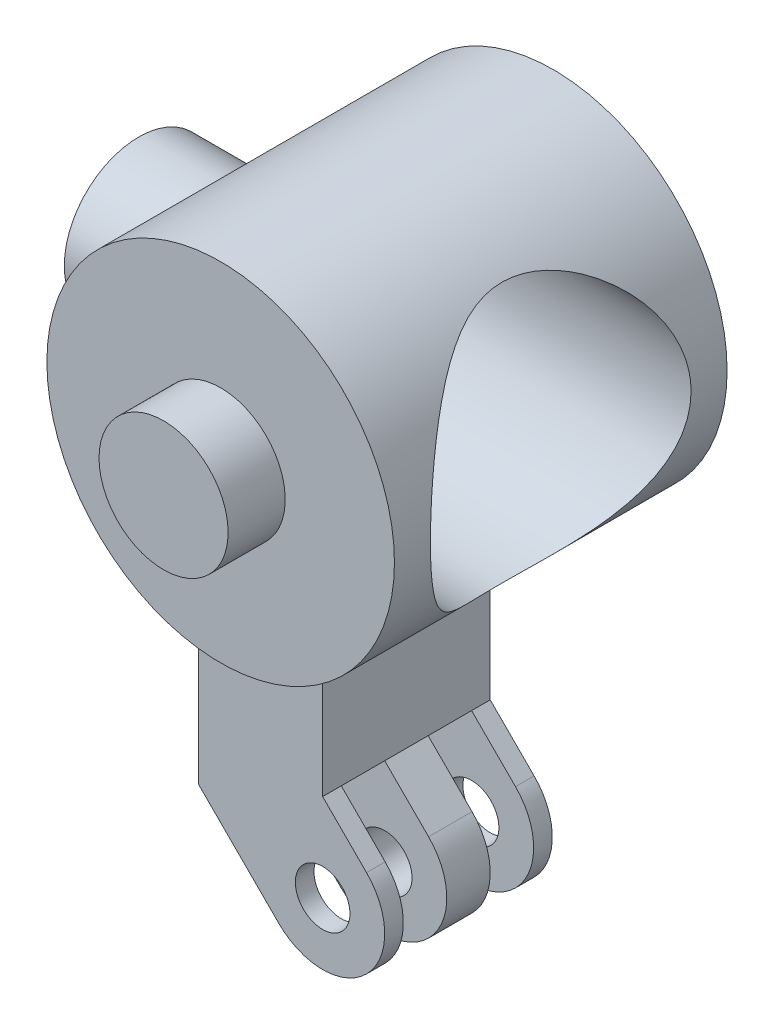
ISO-10303-21;
HEADER;
FILE_DESCRIPTION(('STEP AP214'),'2;1');
FILE_NAME('part.step','',(''),(''),'','','');
FILE_SCHEMA(('AUTOMOTIVE_DESIGN { 1 0 10303 214 1 1 1 1 }'));
ENDSEC;
DATA;
#1=APPLICATION_CONTEXT('core data for automotive mechanical design processes');
#2=APPLICATION_PROTOCOL_DEFINITION('international standard','automotive_design',2000,#1);
#3=PRODUCT_CONTEXT('',#1,'mechanical');
#4=PRODUCT('Part','Part','',(#3));
#5=PRODUCT_RELATED_PRODUCT_CATEGORY('part','',(#4));
#6=PRODUCT_DEFINITION_FORMATION('','',#4);
#7=PRODUCT_DEFINITION_CONTEXT('part definition',#1,'design');
#8=PRODUCT_DEFINITION('design','',#6,#7);
#9=PRODUCT_DEFINITION_SHAPE('','',#8);
#10=(LENGTH_UNIT() NAMED_UNIT(*) SI_UNIT(.MILLI.,.METRE.));
#11=(NAMED_UNIT(*) PLANE_ANGLE_UNIT() SI_UNIT($,.RADIAN.));
#12=(NAMED_UNIT(*) SI_UNIT($,.STERADIAN.) SOLID_ANGLE_UNIT());
#13=UNCERTAINTY_MEASURE_WITH_UNIT(LENGTH_MEASURE(1.E-05),#10,'distance_accuracy_value','');
#14=(GEOMETRIC_REPRESENTATION_CONTEXT(3) GLOBAL_UNCERTAINTY_ASSIGNED_CONTEXT((#13)) GLOBAL_UNIT_ASSIGNED_CONTEXT((#10,
#11,#12)) REPRESENTATION_CONTEXT('',''));
#15=CARTESIAN_POINT('',(0.,0.,0.));
#16=DIRECTION('',(0.,0.,1.));
#17=DIRECTION('',(1.,0.,0.));
#18=AXIS2_PLACEMENT_3D('',#15,#16,#17);
#19=CARTESIAN_POINT('',(-28.5875999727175,51.1546126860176,23.4989898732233));
#20=DIRECTION('',(0.,0.,-1.));
#21=DIRECTION('',(1.,0.,0.));
#22=AXIS2_PLACEMENT_3D('',#19,#20,#21);
#23=CYLINDRICAL_SURFACE('',#22,7.);
#24=CARTESIAN_POINT('',(-35.5875999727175,51.1546126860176,-2.));
#25=CARTESIAN_POINT('',(-35.5875940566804,51.3148944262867,-2.00000746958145));
#26=CARTESIAN_POINT('',(-35.5820324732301,51.47544659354,-2.01292131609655));
#27=CARTESIAN_POINT('',(-35.5603391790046,51.7919620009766,-2.06408236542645));
#28=CARTESIAN_POINT('',(-35.5441807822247,51.9479126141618,-2.10239352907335));
#29=CARTESIAN_POINT('',(-35.5030162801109,52.2501473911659,-2.20266976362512));
#30=CARTESIAN_POINT('',(-35.4780408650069,52.3964630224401,-2.2645528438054));
#31=CARTESIAN_POINT('',(-35.4216565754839,52.6764860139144,-2.40986441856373));
#32=CARTESIAN_POINT('',(-35.3902494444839,52.8101967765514,-2.4932870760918));
#33=CARTESIAN_POINT('',(-35.3222781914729,53.068454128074,-2.68392764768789));
#34=CARTESIAN_POINT('',(-35.2855389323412,53.1922531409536,-2.79209525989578));
#35=CARTESIAN_POINT('',(-35.2117765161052,53.4206030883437,-3.02714386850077));
#36=CARTESIAN_POINT('',(-35.1747532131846,53.5251433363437,-3.15403518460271));
#37=CARTESIAN_POINT('',(-35.1024205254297,53.7174695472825,-3.4310327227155));
#38=CARTESIAN_POINT('',(-35.0673045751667,53.804080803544,-3.5820104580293));
#39=CARTESIAN_POINT('',(-35.0055616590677,53.9503446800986,-3.89810942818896));
#40=CARTESIAN_POINT('',(-34.9789300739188,54.0100119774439,-4.06322290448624));
#41=CARTESIAN_POINT('',(-34.9390779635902,54.0975618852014,-4.39430073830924));
#42=CARTESIAN_POINT('',(-34.9252521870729,54.1268876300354,-4.55980770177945));
#43=CARTESIAN_POINT('',(-34.9108484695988,54.1574187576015,-4.89392596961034));
#44=CARTESIAN_POINT('',(-34.9102625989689,54.1586409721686,-5.06253535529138));
#45=CARTESIAN_POINT('',(-34.9218957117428,54.1340126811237,-5.38329990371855));
#46=CARTESIAN_POINT('',(-34.933068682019,54.1103738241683,-5.53567062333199));
#47=CARTESIAN_POINT('',(-34.9651840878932,54.0404204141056,-5.83402758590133));
#48=CARTESIAN_POINT('',(-34.9861285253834,53.994101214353,-5.98001251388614));
#49=CARTESIAN_POINT('',(-35.0359068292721,53.8791892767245,-6.26524715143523));
#50=CARTESIAN_POINT('',(-35.0649029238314,53.8101324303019,-6.40428029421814));
#51=CARTESIAN_POINT('',(-35.1274849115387,53.6520357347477,-6.66934632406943));
#52=CARTESIAN_POINT('',(-35.1610726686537,53.5629877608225,-6.79537389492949));
#53=CARTESIAN_POINT('',(-35.2327240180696,53.3580467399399,-7.04277750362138));
#54=CARTESIAN_POINT('',(-35.2709185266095,53.2404599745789,-7.16271672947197));
#55=CARTESIAN_POINT('',(-35.3449460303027,52.9864860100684,-7.38167159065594));
#56=CARTESIAN_POINT('',(-35.380778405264,52.8500939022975,-7.48068174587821));
#57=CARTESIAN_POINT('',(-35.4471969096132,52.5577985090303,-7.65724393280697));
#58=CARTESIAN_POINT('',(-35.4776245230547,52.4014838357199,-7.73417901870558));
#59=CARTESIAN_POINT('',(-35.528573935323,52.0764923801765,-7.86015023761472));
#60=CARTESIAN_POINT('',(-35.5491015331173,51.9078229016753,-7.9092027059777));
#61=CARTESIAN_POINT('',(-35.5768352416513,51.574888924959,-7.97493386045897));
#62=CARTESIAN_POINT('',(-35.5848324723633,51.4110706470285,-7.99353876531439));
#63=CARTESIAN_POINT('',(-35.5891541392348,51.0824693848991,-8.00362957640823));
#64=CARTESIAN_POINT('',(-35.5854821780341,50.9176867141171,-7.99512385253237));
#65=CARTESIAN_POINT('',(-35.567386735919,50.6010702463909,-7.95258436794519));
#66=CARTESIAN_POINT('',(-35.5535451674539,50.4490137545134,-7.91993167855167));
#67=CARTESIAN_POINT('',(-35.5171388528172,50.1527215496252,-7.83197910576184));
#68=CARTESIAN_POINT('',(-35.4945730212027,50.0084868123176,-7.77667640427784));
#69=CARTESIAN_POINT('',(-35.4419874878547,49.7268357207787,-7.64319884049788));
#70=CARTESIAN_POINT('',(-35.4117570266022,49.5897729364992,-7.56436366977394));
#71=CARTESIAN_POINT('',(-35.3470298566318,49.3303277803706,-7.38678105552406));
#72=CARTESIAN_POINT('',(-35.312531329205,49.2079517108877,-7.28802511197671));
#73=CARTESIAN_POINT('',(-35.2397478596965,48.9716450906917,-7.06471041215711));
#74=CARTESIAN_POINT('',(-35.2013735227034,48.8590465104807,-6.93876778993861));
#75=CARTESIAN_POINT('',(-35.12744034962,48.6561783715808,-6.66921770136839));
#76=CARTESIAN_POINT('',(-35.0918822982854,48.5659150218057,-6.52560533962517));
#77=CARTESIAN_POINT('',(-35.0272296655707,48.4089739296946,-6.22118614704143));
#78=CARTESIAN_POINT('',(-34.9982625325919,48.3427485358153,-6.06011699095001));
#79=CARTESIAN_POINT('',(-34.9517360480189,48.2389538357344,-5.72747367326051));
#80=CARTESIAN_POINT('',(-34.9341665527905,48.2013590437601,-5.55590900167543));
#81=CARTESIAN_POINT('',(-34.9140347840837,48.1584932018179,-5.22200882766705));
#82=CARTESIAN_POINT('',(-34.9103792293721,48.1508657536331,-5.06004073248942));
#83=CARTESIAN_POINT('',(-34.9155561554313,48.1617861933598,-4.73721025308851));
#84=CARTESIAN_POINT('',(-34.9243864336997,48.1803294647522,-4.57634767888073));
#85=CARTESIAN_POINT('',(-34.9525165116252,48.2410483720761,-4.26895830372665));
#86=CARTESIAN_POINT('',(-34.9712471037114,48.2819429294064,-4.12212120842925));
#87=CARTESIAN_POINT('',(-35.0165887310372,48.3849104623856,-3.83737923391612));
#88=CARTESIAN_POINT('',(-35.0432020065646,48.446989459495,-3.69947690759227));
#89=CARTESIAN_POINT('',(-35.1033524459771,48.5949801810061,-3.42717929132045));
#90=CARTESIAN_POINT('',(-35.1372164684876,48.6821303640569,-3.29353084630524));
#91=CARTESIAN_POINT('',(-35.2071977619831,48.8761166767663,-3.04201763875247));
#92=CARTESIAN_POINT('',(-35.2433158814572,48.9829602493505,-2.92415887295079));
#93=CARTESIAN_POINT('',(-35.3171542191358,49.2232621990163,-2.69799636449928));
#94=CARTESIAN_POINT('',(-35.3547759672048,49.3581554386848,-2.59118043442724));
#95=CARTESIAN_POINT('',(-35.4245647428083,49.6454150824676,-2.40156023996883));
#96=CARTESIAN_POINT('',(-35.4567292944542,49.7977893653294,-2.31876686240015));
#97=CARTESIAN_POINT('',(-35.4979543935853,50.0350673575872,-2.21540730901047));
#98=CARTESIAN_POINT('',(-35.510463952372,50.1150398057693,-2.18456670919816));
#99=CARTESIAN_POINT('',(-35.5329319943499,50.2776418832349,-2.12976179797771));
#100=CARTESIAN_POINT('',(-35.5428916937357,50.3602702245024,-2.10579420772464));
#101=CARTESIAN_POINT('',(-35.559943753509,50.5273471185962,-2.06505228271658));
#102=CARTESIAN_POINT('',(-35.5670431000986,50.6117906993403,-2.04826041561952));
#103=CARTESIAN_POINT('',(-35.5781931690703,50.7819647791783,-2.02199128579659));
#104=CARTESIAN_POINT('',(-35.5822460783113,50.8676943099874,-2.0125087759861));
#105=CARTESIAN_POINT('',(-35.5856758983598,50.9871200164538,-2.00449172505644));
#106=CARTESIAN_POINT('',(-35.5863967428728,51.0205915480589,-2.00280814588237));
#107=CARTESIAN_POINT('',(-35.5873594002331,51.0875756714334,-2.00056149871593));
#108=CARTESIAN_POINT('',(-35.5876012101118,51.1210882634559,-1.99999843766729));
#109=CARTESIAN_POINT('',(-35.5875999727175,51.1546126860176,-2.));
#110=B_SPLINE_CURVE_WITH_KNOTS('',3,(#24,#25,#26,#27,#28,#29,#30,#31,#32,#33,#34,#35,#36,#37,
#38,#39,#40,#41,#42,#43,#44,#45,#46,#47,#48,#49,#50,#51,#52,#53,#54,#55,#56,#57,#58,#59,#60,#61,
#62,#63,#64,#65,#66,#67,#68,#69,#70,#71,#72,#73,#74,#75,#76,#77,#78,#79,#80,#81,#82,#83,#84,#85,
#86,#87,#88,#89,#90,#91,#92,#93,#94,#95,#96,#97,#98,#99,#100,#101,#102,#103,#104,#105,#106,#107,
#108,#109),.UNSPECIFIED.,.T.,.F.,(4,2,2,2,2,2,2,2,2,2,2,2,2,2,2,2,2,2,2,2,2,2,2,2,2,2,2,2,2,2,2,
2,2,2,2,2,2,2,2,2,2,2,4),(0.,0.480714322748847,0.962643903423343,1.44291226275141,
1.92305060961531,2.42622743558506,2.92968263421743,3.45969560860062,3.98941952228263,
4.492594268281,4.99546764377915,5.45710720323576,5.91884138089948,6.3906540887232,
6.86265889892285,7.3770983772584,7.89167239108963,8.41947244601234,8.94696296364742,
9.43957347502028,9.93203191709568,10.3983119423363,10.8646499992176,11.3455505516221,
11.8266567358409,12.3440285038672,12.8615439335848,13.3883469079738,13.9146803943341,
14.3986848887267,14.882604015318,15.341320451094,15.8001673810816,16.2874475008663,
16.7749121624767,17.3008416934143,17.8270092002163,18.0865840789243,18.3460349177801,
18.6048481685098,18.8634754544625,18.964020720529,19.0645666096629),.UNSPECIFIED.);
#111=CARTESIAN_POINT('',(-35.5875999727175,51.1546126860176,-2.));
#112=VERTEX_POINT('',#111);
#113=EDGE_CURVE('E275',#112,#112,#110,.T.);
#114=ORIENTED_EDGE('',*,*,#113,.F.);
#115=EDGE_LOOP('',(#114));
#116=FACE_BOUND('',#115,.T.);
#117=CARTESIAN_POINT('',(-28.5875999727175,51.1546126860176,1.7));
#118=DIRECTION('',(0.,0.,-1.));
#119=DIRECTION('',(-1.,0.,0.));
#120=AXIS2_PLACEMENT_3D('',#117,#118,#119);
#121=CIRCLE('',#120,7.);
#122=CARTESIAN_POINT('',(-35.5875999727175,51.1546126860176,1.7));
#123=VERTEX_POINT('',#122);
#124=EDGE_CURVE('E270',#123,#123,#121,.F.);
#125=ORIENTED_EDGE('',*,*,#124,.F.);
#126=EDGE_LOOP('',(#125));
#127=FACE_BOUND('',#126,.T.);
#128=CARTESIAN_POINT('',(-28.5875999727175,51.1546126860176,-11.7));
#129=DIRECTION('',(0.,0.,1.));
#130=DIRECTION('',(1.,0.,0.));
#131=AXIS2_PLACEMENT_3D('',#128,#129,#130);
#132=CIRCLE('',#131,7.);
#133=CARTESIAN_POINT('',(-21.5875999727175,51.1546126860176,-11.7));
#134=VERTEX_POINT('',#133);
#135=EDGE_CURVE('E267',#134,#134,#132,.T.);
#136=ORIENTED_EDGE('',*,*,#135,.T.);
#137=EDGE_LOOP('',(#136));
#138=FACE_BOUND('',#137,.T.);
#139=CARTESIAN_POINT('',(-21.5875999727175,51.1546126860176,0.25));
#140=CARTESIAN_POINT('',(-21.5876011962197,51.2828165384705,0.249998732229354));
#141=CARTESIAN_POINT('',(-21.591130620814,51.4110524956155,0.245295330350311));
#142=CARTESIAN_POINT('',(-21.605168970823,51.6665119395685,0.2265552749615));
#143=CARTESIAN_POINT('',(-21.6156820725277,51.7937347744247,0.212513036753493));
#144=CARTESIAN_POINT('',(-21.6434657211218,52.0463376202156,0.175292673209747));
#145=CARTESIAN_POINT('',(-21.6607491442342,52.1717136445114,0.152097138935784));
#146=CARTESIAN_POINT('',(-21.7016847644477,52.4195052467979,0.096927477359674));
#147=CARTESIAN_POINT('',(-21.7253398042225,52.5419194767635,0.0649494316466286));
#148=CARTESIAN_POINT('',(-21.7783333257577,52.7821616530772,-0.00708457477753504));
#149=CARTESIAN_POINT('',(-21.8076333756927,52.900014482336,-0.0470859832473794));
#150=CARTESIAN_POINT('',(-21.8714395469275,53.1313816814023,-0.134795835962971));
#151=CARTESIAN_POINT('',(-21.905947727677,53.244894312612,-0.182507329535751));
#152=CARTESIAN_POINT('',(-22.0163020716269,53.5779594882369,-0.336353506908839));
#153=CARTESIAN_POINT('',(-22.0990495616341,53.7903522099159,-0.453295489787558));
#154=CARTESIAN_POINT('',(-22.2858703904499,54.2117789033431,-0.723930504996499));
#155=CARTESIAN_POINT('',(-22.3912089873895,54.4186804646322,-0.880023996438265));
#156=CARTESIAN_POINT('',(-22.6107695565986,54.8052163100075,-1.21824710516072));
#157=CARTESIAN_POINT('',(-22.7250051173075,54.9848075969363,-1.4004169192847));
#158=CARTESIAN_POINT('',(-22.908986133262,55.2494953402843,-1.71093747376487));
#159=CARTESIAN_POINT('',(-22.9783440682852,55.3437535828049,-1.83185332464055));
#160=CARTESIAN_POINT('',(-23.1157543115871,55.5217085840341,-2.08203035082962));
#161=CARTESIAN_POINT('',(-23.1838062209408,55.6054021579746,-2.21129402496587));
#162=CARTESIAN_POINT('',(-23.3164288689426,55.7616996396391,-2.47787979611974));
#163=CARTESIAN_POINT('',(-23.3810030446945,55.8343146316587,-2.61519364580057));
#164=CARTESIAN_POINT('',(-23.5042350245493,55.9678915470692,-2.89779004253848));
#165=CARTESIAN_POINT('',(-23.5628961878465,56.0288601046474,-3.04306799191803));
#166=CARTESIAN_POINT('',(-23.688398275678,56.1554188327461,-3.3882174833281));
#167=CARTESIAN_POINT('',(-23.7520888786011,56.2165253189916,-3.59099031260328));
#168=CARTESIAN_POINT('',(-23.8305210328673,56.289929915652,-3.90342880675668));
#169=CARTESIAN_POINT('',(-23.8538061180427,56.3113486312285,-4.00889288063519));
#170=CARTESIAN_POINT('',(-23.8938122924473,56.3477900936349,-4.22212616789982));
#171=CARTESIAN_POINT('',(-23.9105367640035,56.3628161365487,-4.32989416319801));
#172=CARTESIAN_POINT('',(-23.9368035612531,56.3862863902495,-4.54806927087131));
#173=CARTESIAN_POINT('',(-23.9462764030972,56.3946669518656,-4.65849170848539));
#174=CARTESIAN_POINT('',(-23.9573028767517,56.4044130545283,-4.88004350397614));
#175=CARTESIAN_POINT('',(-23.9588567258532,56.4057787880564,-4.99117284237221));
#176=CARTESIAN_POINT('',(-23.953959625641,56.4014583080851,-5.21315493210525));
#177=CARTESIAN_POINT('',(-23.9475060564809,56.3957697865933,-5.32400758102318));
#178=CARTESIAN_POINT('',(-23.9269346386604,56.3774833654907,-5.54439475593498));
#179=CARTESIAN_POINT('',(-23.9128167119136,56.3648853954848,-5.65392926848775));
#180=CARTESIAN_POINT('',(-23.8637130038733,56.3205331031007,-5.95602478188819));
#181=CARTESIAN_POINT('',(-23.8210449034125,56.2815038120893,-6.14632390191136));
#182=CARTESIAN_POINT('',(-23.7186077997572,56.1843070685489,-6.5170895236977));
#183=CARTESIAN_POINT('',(-23.6588223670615,56.1261212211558,-6.69754637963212));
#184=CARTESIAN_POINT('',(-23.5399058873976,56.005034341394,-7.01471865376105));
#185=CARTESIAN_POINT('',(-23.4827354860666,55.9450404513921,-7.15331164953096));
#186=CARTESIAN_POINT('',(-23.363204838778,55.8143910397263,-7.42310663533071));
#187=CARTESIAN_POINT('',(-23.3008419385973,55.7437300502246,-7.55430478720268));
#188=CARTESIAN_POINT('',(-23.172975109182,55.5921449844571,-7.80942488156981));
#189=CARTESIAN_POINT('',(-23.1074649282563,55.5111999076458,-7.93333115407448));
#190=CARTESIAN_POINT('',(-22.9752694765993,55.3395246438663,-8.17345128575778));
#191=CARTESIAN_POINT('',(-22.9085843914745,55.2487959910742,-8.28966634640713));
#192=CARTESIAN_POINT('',(-22.773958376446,55.0553552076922,-8.5170343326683));
#193=CARTESIAN_POINT('',(-22.7060279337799,54.9523994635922,-8.62798699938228));
#194=CARTESIAN_POINT('',(-22.5721726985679,54.7366231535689,-8.84118916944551));
#195=CARTESIAN_POINT('',(-22.5062487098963,54.6237987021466,-8.94343521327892));
#196=CARTESIAN_POINT('',(-22.3140072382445,54.2712403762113,-9.23581417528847));
#197=CARTESIAN_POINT('',(-22.1928024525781,54.016844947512,-9.41226990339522));
#198=CARTESIAN_POINT('',(-21.9977858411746,53.5271983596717,-9.68996462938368));
#199=CARTESIAN_POINT('',(-21.9193442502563,53.2983396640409,-9.79919123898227));
#200=CARTESIAN_POINT('',(-21.8182195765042,52.9409166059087,-9.93842210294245));
#201=CARTESIAN_POINT('',(-21.7872617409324,52.8193863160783,-9.98073868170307));
#202=CARTESIAN_POINT('',(-21.7314900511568,52.5722770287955,-10.0566203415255));
#203=CARTESIAN_POINT('',(-21.7066735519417,52.446699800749,-10.0901891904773));
#204=CARTESIAN_POINT('',(-21.6636006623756,52.1914794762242,-10.1482664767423));
#205=CARTESIAN_POINT('',(-21.6453877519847,52.0618153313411,-10.1727148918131));
#206=CARTESIAN_POINT('',(-21.6161921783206,51.8002068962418,-10.2118323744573));
#207=CARTESIAN_POINT('',(-21.6052095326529,51.6682626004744,-10.2265014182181));
#208=CARTESIAN_POINT('',(-21.5907600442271,51.4032739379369,-10.2457897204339));
#209=CARTESIAN_POINT('',(-21.587290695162,51.270229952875,-10.250412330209));
#210=CARTESIAN_POINT('',(-21.5879524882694,51.0042008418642,-10.2495300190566));
#211=CARTESIAN_POINT('',(-21.5920830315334,50.8712157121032,-10.2440258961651));
#212=CARTESIAN_POINT('',(-21.6070368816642,50.6198628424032,-10.2240595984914));
#213=CARTESIAN_POINT('',(-21.6171428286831,50.5013741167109,-10.2105573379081));
#214=CARTESIAN_POINT('',(-21.6431998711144,50.2661807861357,-10.175647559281));
#215=CARTESIAN_POINT('',(-21.6591529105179,50.1494767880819,-10.1542374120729));
#216=CARTESIAN_POINT('',(-21.6965853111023,49.9186600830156,-10.1038092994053));
#217=CARTESIAN_POINT('',(-21.7180633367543,49.8045467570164,-10.0747931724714));
#218=CARTESIAN_POINT('',(-21.7661422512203,49.5794993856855,-10.0095177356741));
#219=CARTESIAN_POINT('',(-21.7927451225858,49.4685665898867,-9.97325562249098));
#220=CARTESIAN_POINT('',(-21.8815843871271,49.1337852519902,-9.85142686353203));
#221=CARTESIAN_POINT('',(-21.9515212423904,48.9159470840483,-9.7545807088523));
#222=CARTESIAN_POINT('',(-22.106762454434,48.4997613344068,-9.53538656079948));
#223=CARTESIAN_POINT('',(-22.1920689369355,48.3014164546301,-9.41303503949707));
#224=CARTESIAN_POINT('',(-22.388422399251,47.8943391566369,-9.12376581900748));
#225=CARTESIAN_POINT('',(-22.501388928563,47.6894036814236,-8.9528178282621));
#226=CARTESIAN_POINT('',(-22.7342593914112,47.3090688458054,-8.58395160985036));
#227=CARTESIAN_POINT('',(-22.8541783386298,47.1337368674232,-8.38597366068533));
#228=CARTESIAN_POINT('',(-23.0438808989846,46.8789515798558,-8.0505572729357));
#229=CARTESIAN_POINT('',(-23.1143214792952,46.7894047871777,-7.92102721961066));
#230=CARTESIAN_POINT('',(-23.2524168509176,46.6216658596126,-7.65327475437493));
#231=CARTESIAN_POINT('',(-23.3200706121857,46.5434778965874,-7.51504917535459));
#232=CARTESIAN_POINT('',(-23.4498889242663,46.3992661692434,-7.23037263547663));
#233=CARTESIAN_POINT('',(-23.512066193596,46.3332138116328,-7.08394209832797));
#234=CARTESIAN_POINT('',(-23.6280696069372,46.213968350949,-6.78290575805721));
#235=CARTESIAN_POINT('',(-23.6819026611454,46.1607645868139,-6.62830686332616));
#236=CARTESIAN_POINT('',(-23.7884298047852,46.0580798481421,-6.27608541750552));
#237=CARTESIAN_POINT('',(-23.8382376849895,46.0120258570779,-6.0765107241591));
#238=CARTESIAN_POINT('',(-23.894830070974,45.9605255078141,-5.77112968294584));
#239=CARTESIAN_POINT('',(-23.9106706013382,45.9462917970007,-5.668390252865));
#240=CARTESIAN_POINT('',(-23.9357257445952,45.9238999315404,-5.46146664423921));
#241=CARTESIAN_POINT('',(-23.9449433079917,45.9157390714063,-5.35728313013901));
#242=CARTESIAN_POINT('',(-23.9563699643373,45.9056349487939,-5.14766674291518));
#243=CARTESIAN_POINT('',(-23.9585410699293,45.9037253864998,-5.04223016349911));
#244=CARTESIAN_POINT('',(-23.955668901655,45.9062588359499,-4.83153480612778));
#245=CARTESIAN_POINT('',(-23.9506257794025,45.9107017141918,-4.72627602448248));
#246=CARTESIAN_POINT('',(-23.9335516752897,45.9258496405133,-4.51669099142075));
#247=CARTESIAN_POINT('',(-23.9215142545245,45.9365604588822,-4.41236568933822));
#248=CARTESIAN_POINT('',(-23.8909688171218,45.9640371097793,-4.2054377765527));
#249=CARTESIAN_POINT('',(-23.8724574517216,45.9808060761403,-4.1028360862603));
#250=CARTESIAN_POINT('',(-23.8250310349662,46.0243897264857,-3.87788699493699));
#251=CARTESIAN_POINT('',(-23.7947285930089,46.0525964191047,-3.7561017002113));
#252=CARTESIAN_POINT('',(-23.7270747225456,46.1170069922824,-3.51661640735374));
#253=CARTESIAN_POINT('',(-23.6897179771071,46.1532169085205,-3.39891957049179));
#254=CARTESIAN_POINT('',(-23.6093869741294,46.2331687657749,-3.16782360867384));
#255=CARTESIAN_POINT('',(-23.5664016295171,46.2769256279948,-3.05443355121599));
#256=CARTESIAN_POINT('',(-23.4762720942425,46.3714554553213,-2.83240615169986));
#257=CARTESIAN_POINT('',(-23.4291291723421,46.4222262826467,-2.72376737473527));
#258=CARTESIAN_POINT('',(-23.3150072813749,46.5492506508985,-2.47434008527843));
#259=CARTESIAN_POINT('',(-23.2468243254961,46.6282313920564,-2.33548572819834));
#260=CARTESIAN_POINT('',(-23.1076583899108,46.7977469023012,-2.06648592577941));
#261=CARTESIAN_POINT('',(-23.0366745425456,46.8882852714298,-1.93634321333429));
#262=CARTESIAN_POINT('',(-22.8940192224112,47.0806115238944,-1.68487012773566));
#263=CARTESIAN_POINT('',(-22.8223472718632,47.1824078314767,-1.56354646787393));
#264=CARTESIAN_POINT('',(-22.6802816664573,47.3969348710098,-1.33019474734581));
#265=CARTESIAN_POINT('',(-22.6098878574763,47.509664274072,-1.21816556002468));
#266=CARTESIAN_POINT('',(-22.4715431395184,47.7468485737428,-1.00306539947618));
#267=CARTESIAN_POINT('',(-22.4036177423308,47.8713940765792,-0.900077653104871));
#268=CARTESIAN_POINT('',(-22.2725625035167,48.1311279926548,-0.704954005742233));
#269=CARTESIAN_POINT('',(-22.2094332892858,48.2663177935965,-0.612819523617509));
#270=CARTESIAN_POINT('',(-22.0898061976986,48.546577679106,-0.440652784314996));
#271=CARTESIAN_POINT('',(-22.0332957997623,48.6916282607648,-0.360597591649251));
#272=CARTESIAN_POINT('',(-21.9284686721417,48.9910300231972,-0.21364636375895));
#273=CARTESIAN_POINT('',(-21.8801477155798,49.1453763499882,-0.146743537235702));
#274=CARTESIAN_POINT('',(-21.8060242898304,49.4157258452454,-0.0448915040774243));
#275=CARTESIAN_POINT('',(-21.7777725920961,49.5297096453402,-0.006323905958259));
#276=CARTESIAN_POINT('',(-21.7266721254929,49.7611632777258,0.0631399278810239));
#277=CARTESIAN_POINT('',(-21.7038220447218,49.8786322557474,0.0940380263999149));
#278=CARTESIAN_POINT('',(-21.6640202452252,50.1161008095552,0.147696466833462));
#279=CARTESIAN_POINT('',(-21.6470548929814,50.2360938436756,0.170475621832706));
#280=CARTESIAN_POINT('',(-21.619310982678,50.47803440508,0.207658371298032));
#281=CARTESIAN_POINT('',(-21.608529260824,50.599980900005,0.222066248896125));
#282=CARTESIAN_POINT('',(-21.5965127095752,50.7942275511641,0.238111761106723));
#283=CARTESIAN_POINT('',(-21.5931734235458,50.8661812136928,0.242566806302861));
#284=CARTESIAN_POINT('',(-21.5887165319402,51.010290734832,0.248511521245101));
#285=CARTESIAN_POINT('',(-21.587599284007,51.0824466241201,0.250000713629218));
#286=CARTESIAN_POINT('',(-21.5875999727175,51.1546126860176,0.25));
#287=B_SPLINE_CURVE_WITH_KNOTS('',3,(#139,#140,#141,#142,#143,#144,#145,#146,#147,#148,#149,
#150,#151,#152,#153,#154,#155,#156,#157,#158,#159,#160,#161,#162,#163,#164,#165,#166,#167,#168,
#169,#170,#171,#172,#173,#174,#175,#176,#177,#178,#179,#180,#181,#182,#183,#184,#185,#186,#187,
#188,#189,#190,#191,#192,#193,#194,#195,#196,#197,#198,#199,#200,#201,#202,#203,#204,#205,#206,
#207,#208,#209,#210,#211,#212,#213,#214,#215,#216,#217,#218,#219,#220,#221,#222,#223,#224,#225,
#226,#227,#228,#229,#230,#231,#232,#233,#234,#235,#236,#237,#238,#239,#240,#241,#242,#243,#244,
#245,#246,#247,#248,#249,#250,#251,#252,#253,#254,#255,#256,#257,#258,#259,#260,#261,#262,#263,
#264,#265,#266,#267,#268,#269,#270,#271,#272,#273,#274,#275,#276,#277,#278,#279,#280,#281,#282,
#283,#284,#285,#286),.UNSPECIFIED.,.T.,.F.,(4,2,2,2,2,2,2,2,2,2,2,2,2,2,2,2,2,2,2,2,2,2,2,2,2,2,
2,2,2,2,2,2,2,2,2,2,2,2,2,2,2,2,2,2,2,2,2,2,2,2,2,2,2,2,2,2,2,2,2,2,2,2,2,2,2,2,2,2,2,2,2,2,2,
4),(0.,0.38453366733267,0.769297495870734,1.15479667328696,1.54046812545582,1.9236011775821,
2.30688613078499,3.07246235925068,3.90893405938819,4.74670935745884,5.25106429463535,
5.75557091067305,6.25956940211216,6.76327993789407,7.42400799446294,7.75399907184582,
8.08381979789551,8.4167625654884,8.7496961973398,9.082738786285,9.41578476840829,
10.0100461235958,10.6048797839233,11.0886886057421,11.572746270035,12.0578087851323,
12.5427953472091,13.0399543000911,13.5373098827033,14.529097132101,15.3219816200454,
15.7186301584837,16.1151075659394,16.5141500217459,16.9131934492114,17.312103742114,
17.7109826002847,18.0696141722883,18.4283650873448,18.7870293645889,19.1458326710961,
19.8880454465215,20.6303609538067,21.4966434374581,22.3648718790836,22.88187214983,
23.399061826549,23.9150168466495,24.4305422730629,25.0601070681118,25.3745481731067,
25.6888491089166,26.0048416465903,26.3208275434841,26.6371047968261,26.9535458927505,
27.3388522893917,27.7244502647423,28.1108195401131,28.4970713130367,29.0174330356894,
29.5379572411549,30.0588736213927,30.5797267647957,31.1049585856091,31.6302589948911,
32.1545490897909,32.6785677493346,33.0490143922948,33.4193709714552,33.7888636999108,
34.1581672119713,34.3745867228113,34.5910410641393),.UNSPECIFIED.);
#288=CARTESIAN_POINT('',(-21.5875999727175,51.1546126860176,0.25));
#289=VERTEX_POINT('',#288);
#290=EDGE_CURVE('E12',#289,#289,#287,.T.);
#291=ORIENTED_EDGE('',*,*,#290,.T.);
#292=EDGE_LOOP('',(#291));
#293=FACE_BOUND('',#292,.T.);
#294=CARTESIAN_POINT('',(-28.5875999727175,51.1546126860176,-9.15757331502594));
#295=DIRECTION('',(0.,0.,1.));
#296=DIRECTION('',(-1.,0.,0.));
#297=AXIS2_PLACEMENT_3D('',#294,#295,#296);
#298=CIRCLE('',#297,7.);
#299=CARTESIAN_POINT('',(-33.5875999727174,46.2556332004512,-9.15757331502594));
#300=VERTEX_POINT('',#299);
#301=CARTESIAN_POINT('',(-28.5875999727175,44.1546126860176,-9.15757331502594));
#302=VERTEX_POINT('',#301);
#303=EDGE_CURVE('E335',#300,#302,#298,.T.);
#304=ORIENTED_EDGE('',*,*,#303,.F.);
#305=DIRECTION('',(0.,0.,-1.));
#306=VECTOR('',#305,1.);
#307=CARTESIAN_POINT('',(-33.5875999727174,46.2556332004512,23.4989898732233));
#308=LINE('',#307,#306);
#309=CARTESIAN_POINT('',(-33.5875999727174,46.2556332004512,-2.40757331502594));
#310=VERTEX_POINT('',#309);
#311=EDGE_CURVE('E53',#300,#310,#308,.F.);
#312=ORIENTED_EDGE('',*,*,#311,.T.);
#313=CARTESIAN_POINT('',(-28.5875999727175,51.1546126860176,-2.40757331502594));
#314=DIRECTION('',(0.,0.,-1.));
#315=DIRECTION('',(1.,0.,0.));
#316=AXIS2_PLACEMENT_3D('',#313,#314,#315);
#317=CIRCLE('',#316,7.);
#318=CARTESIAN_POINT('',(-28.5875999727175,44.1546126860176,-2.40757331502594));
#319=VERTEX_POINT('',#318);
#320=EDGE_CURVE('E198',#319,#310,#317,.T.);
#321=ORIENTED_EDGE('',*,*,#320,.F.);
#322=DIRECTION('',(0.,0.,-1.));
#323=VECTOR('',#322,1.);
#324=CARTESIAN_POINT('',(-28.5875999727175,44.1546126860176,23.4989898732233));
#325=LINE('',#324,#323);
#326=EDGE_CURVE('E60',#319,#302,#325,.T.);
#327=ORIENTED_EDGE('',*,*,#326,.T.);
#328=EDGE_LOOP('',(#304,#312,#321,#327));
#329=FACE_BOUND('',#328,.T.);
#330=ADVANCED_FACE('F37',(#116,#127,#138,#293,#329),#23,.T.);
#331=CARTESIAN_POINT('',(-28.5875999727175,51.1546126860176,-6.65757331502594));
#332=DIRECTION('',(0.,0.,-1.));
#333=DIRECTION('',(1.,0.,0.));
#334=AXIS2_PLACEMENT_3D('',#331,#332,#333);
#335=PLANE('',#334);
#336=CARTESIAN_POINT('',(-28.5875999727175,33.903098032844,-6.65757331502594));
#337=DIRECTION('',(0.,0.,1.));
#338=DIRECTION('',(1.,0.,0.));
#339=AXIS2_PLACEMENT_3D('',#336,#337,#338);
#340=CIRCLE('',#339,1.09999999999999);
#341=CARTESIAN_POINT('',(-27.4875999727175,33.903098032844,-6.65757331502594));
#342=VERTEX_POINT('',#341);
#343=EDGE_CURVE('E239',#342,#342,#340,.T.);
#344=ORIENTED_EDGE('',*,*,#343,.T.);
#345=EDGE_LOOP('',(#344));
#346=FACE_BOUND('',#345,.T.);
#347=DIRECTION('',(0.707106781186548,-0.707106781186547,0.));
#348=VECTOR('',#347,1.);
#349=CARTESIAN_POINT('',(-33.5875999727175,35.3675641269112,-6.65757331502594));
#350=LINE('',#349,#348);
#351=CARTESIAN_POINT('',(-33.5875999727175,35.3675641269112,-6.65757331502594));
#352=VERTEX_POINT('',#351);
#353=CARTESIAN_POINT('',(-30.3553669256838,32.1353310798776,-6.65757331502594));
#354=VERTEX_POINT('',#353);
#355=EDGE_CURVE('E242',#352,#354,#350,.T.);
#356=ORIENTED_EDGE('',*,*,#355,.F.);
#357=DIRECTION('',(-0.923879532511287,-0.382683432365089,0.));
#358=VECTOR('',#357,1.);
#359=CARTESIAN_POINT('',(-28.5875999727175,37.4386319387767,-6.65757331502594));
#360=LINE('',#359,#358);
#361=CARTESIAN_POINT('',(-28.5875999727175,37.4386319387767,-6.65757331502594));
#362=VERTEX_POINT('',#361);
#363=EDGE_CURVE('E167',#362,#352,#360,.T.);
#364=ORIENTED_EDGE('',*,*,#363,.F.);
#365=DIRECTION('',(-0.707106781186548,0.707106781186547,0.));
#366=VECTOR('',#365,1.);
#367=CARTESIAN_POINT('',(-26.8198330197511,35.6708649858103,-6.65757331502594));
#368=LINE('',#367,#366);
#369=CARTESIAN_POINT('',(-26.8198330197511,35.6708649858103,-6.65757331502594));
#370=VERTEX_POINT('',#369);
#371=EDGE_CURVE('E246',#370,#362,#368,.T.);
#372=ORIENTED_EDGE('',*,*,#371,.F.);
#373=CARTESIAN_POINT('',(-28.5875999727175,33.903098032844,-6.65757331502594));
#374=DIRECTION('',(0.,0.,1.));
#375=DIRECTION('',(1.,0.,0.));
#376=AXIS2_PLACEMENT_3D('',#373,#374,#375);
#377=CIRCLE('',#376,2.5);
#378=EDGE_CURVE('E244',#354,#370,#377,.T.);
#379=ORIENTED_EDGE('',*,*,#378,.F.);
#380=EDGE_LOOP('',(#356,#364,#372,#379));
#381=FACE_BOUND('',#380,.T.);
#382=ADVANCED_FACE('F321',(#346,#381),#335,.T.);
#383=CARTESIAN_POINT('',(-28.5875999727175,51.1546126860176,-4.90757331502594));
#384=DIRECTION('',(0.,0.,1.));
#385=DIRECTION('',(-1.,0.,0.));
#386=AXIS2_PLACEMENT_3D('',#383,#384,#385);
#387=PLANE('',#386);
#388=CARTESIAN_POINT('',(-28.5875999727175,33.903098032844,-4.90757331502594));
#389=DIRECTION('',(0.,0.,-1.));
#390=DIRECTION('',(-1.,0.,0.));
#391=AXIS2_PLACEMENT_3D('',#388,#389,#390);
#392=CIRCLE('',#391,1.09999999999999);
#393=CARTESIAN_POINT('',(-29.6875999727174,33.903098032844,-4.90757331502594));
#394=VERTEX_POINT('',#393);
#395=EDGE_CURVE('E249',#394,#394,#392,.T.);
#396=ORIENTED_EDGE('',*,*,#395,.T.);
#397=EDGE_LOOP('',(#396));
#398=FACE_BOUND('',#397,.T.);
#399=DIRECTION('',(0.707106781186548,-0.707106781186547,0.));
#400=VECTOR('',#399,1.);
#401=CARTESIAN_POINT('',(-28.5875999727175,37.4386319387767,-4.90757331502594));
#402=LINE('',#401,#400);
#403=CARTESIAN_POINT('',(-28.5875999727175,37.4386319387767,-4.90757331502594));
#404=VERTEX_POINT('',#403);
#405=CARTESIAN_POINT('',(-26.8198330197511,35.6708649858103,-4.90757331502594));
#406=VERTEX_POINT('',#405);
#407=EDGE_CURVE('E252',#404,#406,#402,.T.);
#408=ORIENTED_EDGE('',*,*,#407,.F.);
#409=DIRECTION('',(0.923879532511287,0.382683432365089,0.));
#410=VECTOR('',#409,1.);
#411=CARTESIAN_POINT('',(-33.5875999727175,35.3675641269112,-4.90757331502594));
#412=LINE('',#411,#410);
#413=CARTESIAN_POINT('',(-33.5875999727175,35.3675641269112,-4.90757331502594));
#414=VERTEX_POINT('',#413);
#415=EDGE_CURVE('E223',#414,#404,#412,.T.);
#416=ORIENTED_EDGE('',*,*,#415,.F.);
#417=DIRECTION('',(-0.707106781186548,0.707106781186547,0.));
#418=VECTOR('',#417,1.);
#419=CARTESIAN_POINT('',(-30.3553669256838,32.1353310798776,-4.90757331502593));
#420=LINE('',#419,#418);
#421=CARTESIAN_POINT('',(-30.3553669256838,32.1353310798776,-4.90757331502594));
#422=VERTEX_POINT('',#421);
#423=EDGE_CURVE('E258',#422,#414,#420,.T.);
#424=ORIENTED_EDGE('',*,*,#423,.F.);
#425=CARTESIAN_POINT('',(-28.5875999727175,33.903098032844,-4.90757331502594));
#426=DIRECTION('',(0.,0.,-1.));
#427=DIRECTION('',(-1.,0.,0.));
#428=AXIS2_PLACEMENT_3D('',#425,#426,#427);
#429=CIRCLE('',#428,2.5);
#430=EDGE_CURVE('E255',#406,#422,#429,.T.);
#431=ORIENTED_EDGE('',*,*,#430,.F.);
#432=EDGE_LOOP('',(#408,#416,#424,#431));
#433=FACE_BOUND('',#432,.T.);
#434=ADVANCED_FACE('F317',(#398,#433),#387,.T.);
#435=CARTESIAN_POINT('',(-28.5875999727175,33.903098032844,-3.79630347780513));
#436=DIRECTION('',(0.,0.,-1.));
#437=DIRECTION('',(1.,0.,0.));
#438=AXIS2_PLACEMENT_3D('',#435,#436,#437);
#439=CYLINDRICAL_SURFACE('',#438,1.1);
#440=ORIENTED_EDGE('',*,*,#395,.F.);
#441=EDGE_LOOP('',(#440));
#442=FACE_BOUND('',#441,.T.);
#443=ORIENTED_EDGE('',*,*,#343,.F.);
#444=EDGE_LOOP('',(#443));
#445=FACE_BOUND('',#444,.T.);
#446=ADVANCED_FACE('F311',(#442,#445),#439,.F.);
#447=CARTESIAN_POINT('',(-26.8198330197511,35.6708649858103,2.71935088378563));
#448=DIRECTION('',(0.707106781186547,0.707106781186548,0.));
#449=DIRECTION('',(-0.707106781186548,0.707106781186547,0.));
#450=AXIS2_PLACEMENT_3D('',#447,#448,#449);
#451=PLANE('',#450);
#452=DIRECTION('',(0.,0.,-1.));
#453=VECTOR('',#452,1.);
#454=CARTESIAN_POINT('',(-28.5875999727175,37.4386319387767,2.71935088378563));
#455=LINE('',#454,#453);
#456=EDGE_CURVE('E375',#404,#362,#455,.T.);
#457=ORIENTED_EDGE('',*,*,#456,.F.);
#458=ORIENTED_EDGE('',*,*,#407,.T.);
#459=DIRECTION('',(0.,0.,-1.));
#460=VECTOR('',#459,1.);
#461=CARTESIAN_POINT('',(-26.8198330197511,35.6708649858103,2.71935088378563));
#462=LINE('',#461,#460);
#463=EDGE_CURVE('E377',#406,#370,#462,.T.);
#464=ORIENTED_EDGE('',*,*,#463,.T.);
#465=ORIENTED_EDGE('',*,*,#371,.T.);
#466=EDGE_LOOP('',(#457,#458,#464,#465));
#467=FACE_BOUND('',#466,.T.);
#468=ADVANCED_FACE('F308',(#467),#451,.T.);
#469=CARTESIAN_POINT('',(-28.5875999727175,33.903098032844,2.71935088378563));
#470=DIRECTION('',(0.,0.,-1.));
#471=DIRECTION('',(1.,0.,0.));
#472=AXIS2_PLACEMENT_3D('',#469,#470,#471);
#473=CYLINDRICAL_SURFACE('',#472,2.5);
#474=ORIENTED_EDGE('',*,*,#463,.F.);
#475=ORIENTED_EDGE('',*,*,#430,.T.);
#476=DIRECTION('',(0.,0.,-1.));
#477=VECTOR('',#476,1.);
#478=CARTESIAN_POINT('',(-30.3553669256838,32.1353310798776,-1.4505144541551));
#479=LINE('',#478,#477);
#480=EDGE_CURVE('E370',#422,#354,#479,.T.);
#481=ORIENTED_EDGE('',*,*,#480,.T.);
#482=ORIENTED_EDGE('',*,*,#378,.T.);
#483=EDGE_LOOP('',(#474,#475,#481,#482));
#484=FACE_BOUND('',#483,.T.);
#485=ADVANCED_FACE('F305',(#484),#473,.T.);
#486=CARTESIAN_POINT('',(-33.5875999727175,35.3675641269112,-1.4505144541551));
#487=DIRECTION('',(0.707106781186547,0.707106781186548,0.));
#488=DIRECTION('',(-0.707106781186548,0.707106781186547,0.));
#489=AXIS2_PLACEMENT_3D('',#486,#487,#488);
#490=PLANE('',#489);
#491=ORIENTED_EDGE('',*,*,#355,.T.);
#492=ORIENTED_EDGE('',*,*,#480,.F.);
#493=ORIENTED_EDGE('',*,*,#423,.T.);
#494=DIRECTION('',(0.,0.,-1.));
#495=VECTOR('',#494,1.);
#496=CARTESIAN_POINT('',(-33.5875999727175,35.3675641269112,-1.4505144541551));
#497=LINE('',#496,#495);
#498=EDGE_CURVE('E361',#414,#352,#497,.T.);
#499=ORIENTED_EDGE('',*,*,#498,.T.);
#500=EDGE_LOOP('',(#491,#492,#493,#499));
#501=FACE_BOUND('',#500,.T.);
#502=ADVANCED_FACE('F302',(#501),#490,.F.);
#503=CARTESIAN_POINT('',(-33.5875999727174,51.1546126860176,-5.));
#504=DIRECTION('',(1.,0.,0.));
#505=DIRECTION('',(0.,0.,1.));
#506=AXIS2_PLACEMENT_3D('',#503,#504,#505);
#507=PLANE('',#506);
#508=ORIENTED_EDGE('',*,*,#311,.F.);
#509=DIRECTION('',(0.,1.,0.));
#510=VECTOR('',#509,1.);
#511=CARTESIAN_POINT('',(-33.5875999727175,35.3675641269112,-9.15757331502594));
#512=LINE('',#511,#510);
#513=CARTESIAN_POINT('',(-33.5875999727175,35.3675641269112,-9.15757331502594));
#514=VERTEX_POINT('',#513);
#515=EDGE_CURVE('E151',#514,#300,#512,.T.);
#516=ORIENTED_EDGE('',*,*,#515,.F.);
#517=DIRECTION('',(0.,0.,1.));
#518=VECTOR('',#517,1.);
#519=CARTESIAN_POINT('',(-33.5875999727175,35.3675641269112,-9.15757331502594));
#520=LINE('',#519,#518);
#521=CARTESIAN_POINT('',(-33.5875999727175,35.3675641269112,-8.40757331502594));
#522=VERTEX_POINT('',#521);
#523=EDGE_CURVE('E148',#514,#522,#520,.T.);
#524=ORIENTED_EDGE('',*,*,#523,.T.);
#525=DIRECTION('',(0.,0.,1.));
#526=VECTOR('',#525,1.);
#527=CARTESIAN_POINT('',(-33.5875999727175,35.3675641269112,-8.40757331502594));
#528=LINE('',#527,#526);
#529=EDGE_CURVE('E177',#522,#352,#528,.T.);
#530=ORIENTED_EDGE('',*,*,#529,.T.);
#531=ORIENTED_EDGE('',*,*,#498,.F.);
#532=DIRECTION('',(0.,0.,-1.));
#533=VECTOR('',#532,1.);
#534=CARTESIAN_POINT('',(-33.5875999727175,35.3675641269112,-3.15757331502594));
#535=LINE('',#534,#533);
#536=CARTESIAN_POINT('',(-33.5875999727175,35.3675641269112,-3.15757331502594));
#537=VERTEX_POINT('',#536);
#538=EDGE_CURVE('E231',#537,#414,#535,.T.);
#539=ORIENTED_EDGE('',*,*,#538,.F.);
#540=DIRECTION('',(0.,0.,-1.));
#541=VECTOR('',#540,1.);
#542=CARTESIAN_POINT('',(-33.5875999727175,35.3675641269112,-2.40757331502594));
#543=LINE('',#542,#541);
#544=CARTESIAN_POINT('',(-33.5875999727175,35.3675641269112,-2.40757331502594));
#545=VERTEX_POINT('',#544);
#546=EDGE_CURVE('E214',#545,#537,#543,.T.);
#547=ORIENTED_EDGE('',*,*,#546,.F.);
#548=DIRECTION('',(0.,-1.,0.));
#549=VECTOR('',#548,1.);
#550=CARTESIAN_POINT('',(-33.5875999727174,46.2556332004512,-2.40757331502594));
#551=LINE('',#550,#549);
#552=EDGE_CURVE('E201',#310,#545,#551,.T.);
#553=ORIENTED_EDGE('',*,*,#552,.F.);
#554=EDGE_LOOP('',(#508,#516,#524,#530,#531,#539,#547,#553));
#555=FACE_BOUND('',#554,.T.);
#556=ADVANCED_FACE('F299',(#555),#507,.F.);
#557=CARTESIAN_POINT('',(-28.5875999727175,56.1546126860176,-10.));
#558=DIRECTION('',(-1.,0.,0.));
#559=DIRECTION('',(0.,0.,-1.));
#560=AXIS2_PLACEMENT_3D('',#557,#558,#559);
#561=PLANE('',#560);
#562=ORIENTED_EDGE('',*,*,#456,.T.);
#563=DIRECTION('',(0.,0.,1.));
#564=VECTOR('',#563,1.);
#565=CARTESIAN_POINT('',(-28.5875999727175,37.4386319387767,-8.40757331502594));
#566=LINE('',#565,#564);
#567=CARTESIAN_POINT('',(-28.5875999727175,37.4386319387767,-8.40757331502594));
#568=VERTEX_POINT('',#567);
#569=EDGE_CURVE('E180',#568,#362,#566,.T.);
#570=ORIENTED_EDGE('',*,*,#569,.F.);
#571=DIRECTION('',(0.,0.,1.));
#572=VECTOR('',#571,1.);
#573=CARTESIAN_POINT('',(-28.5875999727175,37.4386319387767,-9.15757331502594));
#574=LINE('',#573,#572);
#575=CARTESIAN_POINT('',(-28.5875999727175,37.4386319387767,-9.15757331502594));
#576=VERTEX_POINT('',#575);
#577=EDGE_CURVE('E172',#576,#568,#574,.T.);
#578=ORIENTED_EDGE('',*,*,#577,.F.);
#579=DIRECTION('',(0.,-1.,0.));
#580=VECTOR('',#579,1.);
#581=CARTESIAN_POINT('',(-28.5875999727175,44.1546126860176,-9.15757331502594));
#582=LINE('',#581,#580);
#583=EDGE_CURVE('E337',#302,#576,#582,.T.);
#584=ORIENTED_EDGE('',*,*,#583,.F.);
#585=ORIENTED_EDGE('',*,*,#326,.F.);
#586=DIRECTION('',(0.,1.,0.));
#587=VECTOR('',#586,1.);
#588=CARTESIAN_POINT('',(-28.5875999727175,37.4386319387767,-2.40757331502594));
#589=LINE('',#588,#587);
#590=CARTESIAN_POINT('',(-28.5875999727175,37.4386319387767,-2.40757331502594));
#591=VERTEX_POINT('',#590);
#592=EDGE_CURVE('E195',#591,#319,#589,.T.);
#593=ORIENTED_EDGE('',*,*,#592,.F.);
#594=DIRECTION('',(0.,0.,-1.));
#595=VECTOR('',#594,1.);
#596=CARTESIAN_POINT('',(-28.5875999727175,37.4386319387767,-2.40757331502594));
#597=LINE('',#596,#595);
#598=CARTESIAN_POINT('',(-28.5875999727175,37.4386319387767,-3.15757331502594));
#599=VERTEX_POINT('',#598);
#600=EDGE_CURVE('E217',#591,#599,#597,.T.);
#601=ORIENTED_EDGE('',*,*,#600,.T.);
#602=DIRECTION('',(0.,0.,-1.));
#603=VECTOR('',#602,1.);
#604=CARTESIAN_POINT('',(-28.5875999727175,37.4386319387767,-3.15757331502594));
#605=LINE('',#604,#603);
#606=EDGE_CURVE('E227',#599,#404,#605,.T.);
#607=ORIENTED_EDGE('',*,*,#606,.T.);
#608=EDGE_LOOP('',(#562,#570,#578,#584,#585,#593,#601,#607));
#609=FACE_BOUND('',#608,.T.);
#610=ADVANCED_FACE('F39',(#609),#561,.F.);
#611=CARTESIAN_POINT('',(-28.5875999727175,51.1546126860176,-16.6381900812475));
#612=DIRECTION('',(0.,0.,-1.));
#613=DIRECTION('',(1.,0.,0.));
#614=AXIS2_PLACEMENT_3D('',#611,#612,#613);
#615=CYLINDRICAL_SURFACE('',#614,2.60000000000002);
#616=CARTESIAN_POINT('',(-28.5875999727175,51.1546126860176,1.7));
#617=DIRECTION('',(0.,0.,-1.));
#618=DIRECTION('',(-1.,0.,0.));
#619=AXIS2_PLACEMENT_3D('',#616,#617,#618);
#620=CIRCLE('',#619,2.60000000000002);
#621=CARTESIAN_POINT('',(-31.1875999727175,51.1546126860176,1.7));
#622=VERTEX_POINT('',#621);
#623=EDGE_CURVE('E46',#622,#622,#620,.F.);
#624=ORIENTED_EDGE('',*,*,#623,.T.);
#625=EDGE_LOOP('',(#624));
#626=FACE_BOUND('',#625,.T.);
#627=CARTESIAN_POINT('',(-28.5875999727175,51.1546126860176,4.));
#628=DIRECTION('',(0.,0.,-1.));
#629=DIRECTION('',(-1.,0.,0.));
#630=AXIS2_PLACEMENT_3D('',#627,#628,#629);
#631=CIRCLE('',#630,2.60000000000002);
#632=CARTESIAN_POINT('',(-31.1875999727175,51.1546126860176,4.));
#633=VERTEX_POINT('',#632);
#634=EDGE_CURVE('E261',#633,#633,#631,.T.);
#635=ORIENTED_EDGE('',*,*,#634,.T.);
#636=EDGE_LOOP('',(#635));
#637=FACE_BOUND('',#636,.T.);
#638=ADVANCED_FACE('F413',(#626,#637),#615,.T.);
#639=CARTESIAN_POINT('',(-28.5875999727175,51.1546126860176,-11.7));
#640=DIRECTION('',(0.,0.,-1.));
#641=DIRECTION('',(1.,0.,0.));
#642=AXIS2_PLACEMENT_3D('',#639,#640,#641);
#643=PLANE('',#642);
#644=CARTESIAN_POINT('',(-28.5875999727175,51.1546126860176,-11.7));
#645=DIRECTION('',(0.,0.,1.));
#646=DIRECTION('',(1.,0.,0.));
#647=AXIS2_PLACEMENT_3D('',#644,#645,#646);
#648=CIRCLE('',#647,2.60000000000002);
#649=CARTESIAN_POINT('',(-25.9875999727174,51.1546126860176,-11.7));
#650=VERTEX_POINT('',#649);
#651=EDGE_CURVE('E381',#650,#650,#648,.F.);
#652=ORIENTED_EDGE('',*,*,#651,.F.);
#653=EDGE_LOOP('',(#652));
#654=FACE_BOUND('',#653,.T.);
#655=ORIENTED_EDGE('',*,*,#135,.F.);
#656=EDGE_LOOP('',(#655));
#657=FACE_BOUND('',#656,.T.);
#658=ADVANCED_FACE('F410',(#654,#657),#643,.T.);
#659=CARTESIAN_POINT('',(-28.5875999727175,53.7546126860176,1.7));
#660=DIRECTION('',(0.,0.,1.));
#661=DIRECTION('',(-1.,0.,0.));
#662=AXIS2_PLACEMENT_3D('',#659,#660,#661);
#663=PLANE('',#662);
#664=ORIENTED_EDGE('',*,*,#623,.F.);
#665=EDGE_LOOP('',(#664));
#666=FACE_BOUND('',#665,.T.);
#667=ORIENTED_EDGE('',*,*,#124,.T.);
#668=EDGE_LOOP('',(#667));
#669=FACE_BOUND('',#668,.T.);
#670=ADVANCED_FACE('F412',(#666,#669),#663,.T.);
#671=ORIENTED_EDGE('',*,*,#651,.T.);
#672=EDGE_LOOP('',(#671));
#673=FACE_BOUND('',#672,.T.);
#674=CARTESIAN_POINT('',(-28.5875999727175,51.1546126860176,-14.));
#675=DIRECTION('',(0.,0.,1.));
#676=DIRECTION('',(1.,0.,0.));
#677=AXIS2_PLACEMENT_3D('',#674,#675,#676);
#678=CIRCLE('',#677,2.60000000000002);
#679=CARTESIAN_POINT('',(-25.9875999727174,51.1546126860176,-14.));
#680=VERTEX_POINT('',#679);
#681=EDGE_CURVE('E264',#680,#680,#678,.T.);
#682=ORIENTED_EDGE('',*,*,#681,.T.);
#683=EDGE_LOOP('',(#682));
#684=FACE_BOUND('',#683,.T.);
#685=ADVANCED_FACE('F292',(#673,#684),#615,.T.);
#686=CARTESIAN_POINT('',(-38.5875999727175,51.1546126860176,-5.));
#687=DIRECTION('',(1.,0.,0.));
#688=DIRECTION('',(0.,0.,1.));
#689=AXIS2_PLACEMENT_3D('',#686,#687,#688);
#690=CYLINDRICAL_SURFACE('',#689,3.);
#691=ORIENTED_EDGE('',*,*,#113,.T.);
#692=EDGE_LOOP('',(#691));
#693=FACE_BOUND('',#692,.T.);
#694=CARTESIAN_POINT('',(-38.5875999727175,51.1546126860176,-5.));
#695=DIRECTION('',(-1.,0.,0.));
#696=DIRECTION('',(0.,0.,1.));
#697=AXIS2_PLACEMENT_3D('',#694,#695,#696);
#698=CIRCLE('',#697,3.);
#699=CARTESIAN_POINT('',(-38.5875999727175,51.1546126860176,-2.));
#700=VERTEX_POINT('',#699);
#701=EDGE_CURVE('E274',#700,#700,#698,.T.);
#702=ORIENTED_EDGE('',*,*,#701,.F.);
#703=EDGE_LOOP('',(#702));
#704=FACE_BOUND('',#703,.T.);
#705=ADVANCED_FACE('F286',(#693,#704),#690,.T.);
#706=CARTESIAN_POINT('',(-38.5875999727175,51.1546126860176,-5.));
#707=DIRECTION('',(1.,0.,0.));
#708=DIRECTION('',(0.,0.,1.));
#709=AXIS2_PLACEMENT_3D('',#706,#707,#708);
#710=PLANE('',#709);
#711=CARTESIAN_POINT('',(-38.5875999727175,51.1546126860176,-5.));
#712=DIRECTION('',(1.,0.,0.));
#713=DIRECTION('',(0.,0.,-1.));
#714=AXIS2_PLACEMENT_3D('',#711,#712,#713);
#715=CIRCLE('',#714,1.75);
#716=CARTESIAN_POINT('',(-38.5875999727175,51.1546126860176,-6.75));
#717=VERTEX_POINT('',#716);
#718=EDGE_CURVE('E233',#717,#717,#715,.T.);
#719=ORIENTED_EDGE('',*,*,#718,.T.);
#720=EDGE_LOOP('',(#719));
#721=FACE_BOUND('',#720,.T.);
#722=ORIENTED_EDGE('',*,*,#701,.T.);
#723=EDGE_LOOP('',(#722));
#724=FACE_BOUND('',#723,.T.);
#725=ADVANCED_FACE('F291',(#721,#724),#710,.F.);
#726=CARTESIAN_POINT('',(-30.5875999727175,51.1546126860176,-5.));
#727=DIRECTION('',(-1.,0.,0.));
#728=DIRECTION('',(0.,0.,-1.));
#729=AXIS2_PLACEMENT_3D('',#726,#727,#728);
#730=PLANE('',#729);
#731=CARTESIAN_POINT('',(-30.5875999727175,51.1546126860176,-5.));
#732=DIRECTION('',(-1.,0.,0.));
#733=DIRECTION('',(0.,0.,1.));
#734=AXIS2_PLACEMENT_3D('',#731,#732,#733);
#735=CIRCLE('',#734,1.75);
#736=CARTESIAN_POINT('',(-30.5875999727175,51.1546126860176,-3.25));
#737=VERTEX_POINT('',#736);
#738=EDGE_CURVE('E41',#737,#737,#735,.T.);
#739=ORIENTED_EDGE('',*,*,#738,.T.);
#740=EDGE_LOOP('',(#739));
#741=FACE_BOUND('',#740,.T.);
#742=CARTESIAN_POINT('',(-30.5875999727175,51.1546126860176,-5.));
#743=DIRECTION('',(1.,0.,0.));
#744=DIRECTION('',(0.,0.,-1.));
#745=AXIS2_PLACEMENT_3D('',#742,#743,#744);
#746=CIRCLE('',#745,5.25);
#747=CARTESIAN_POINT('',(-30.5875999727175,51.1546126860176,-10.25));
#748=VERTEX_POINT('',#747);
#749=EDGE_CURVE('E236',#748,#748,#746,.T.);
#750=ORIENTED_EDGE('',*,*,#749,.T.);
#751=EDGE_LOOP('',(#750));
#752=FACE_BOUND('',#751,.T.);
#753=ADVANCED_FACE('F297',(#741,#752),#730,.F.);
#754=CARTESIAN_POINT('',(-28.5875999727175,51.1546126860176,-14.));
#755=DIRECTION('',(0.,0.,-1.));
#756=DIRECTION('',(1.,0.,0.));
#757=AXIS2_PLACEMENT_3D('',#754,#755,#756);
#758=PLANE('',#757);
#759=ORIENTED_EDGE('',*,*,#681,.F.);
#760=EDGE_LOOP('',(#759));
#761=FACE_BOUND('',#760,.T.);
#762=ADVANCED_FACE('F403',(#761),#758,.T.);
#763=CARTESIAN_POINT('',(-28.5875999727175,51.1546126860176,4.));
#764=DIRECTION('',(0.,0.,1.));
#765=DIRECTION('',(-1.,0.,0.));
#766=AXIS2_PLACEMENT_3D('',#763,#764,#765);
#767=PLANE('',#766);
#768=ORIENTED_EDGE('',*,*,#634,.F.);
#769=EDGE_LOOP('',(#768));
#770=FACE_BOUND('',#769,.T.);
#771=ADVANCED_FACE('F394',(#770),#767,.T.);
#772=CARTESIAN_POINT('',(-21.5875999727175,51.1546126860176,-5.));
#773=DIRECTION('',(-1.,0.,0.));
#774=DIRECTION('',(0.,0.,1.));
#775=AXIS2_PLACEMENT_3D('',#772,#773,#774);
#776=CYLINDRICAL_SURFACE('',#775,5.25);
#777=ORIENTED_EDGE('',*,*,#290,.F.);
#778=EDGE_LOOP('',(#777));
#779=FACE_BOUND('',#778,.T.);
#780=ORIENTED_EDGE('',*,*,#749,.F.);
#781=EDGE_LOOP('',(#780));
#782=FACE_BOUND('',#781,.T.);
#783=ADVANCED_FACE('F389',(#779,#782),#776,.F.);
#784=CARTESIAN_POINT('',(-21.5875999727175,51.1546126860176,-5.));
#785=DIRECTION('',(-1.,0.,0.));
#786=DIRECTION('',(0.,0.,1.));
#787=AXIS2_PLACEMENT_3D('',#784,#785,#786);
#788=CYLINDRICAL_SURFACE('',#787,1.75);
#789=ORIENTED_EDGE('',*,*,#738,.F.);
#790=EDGE_LOOP('',(#789));
#791=FACE_BOUND('',#790,.T.);
#792=ORIENTED_EDGE('',*,*,#718,.F.);
#793=EDGE_LOOP('',(#792));
#794=FACE_BOUND('',#793,.T.);
#795=ADVANCED_FACE('F393',(#791,#794),#788,.F.);
#796=CARTESIAN_POINT('',(-33.5875999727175,35.3675641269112,-3.15757331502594));
#797=DIRECTION('',(-0.382683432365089,0.923879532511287,0.));
#798=DIRECTION('',(-0.923879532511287,-0.382683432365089,0.));
#799=AXIS2_PLACEMENT_3D('',#796,#797,#798);
#800=PLANE('',#799);
#801=ORIENTED_EDGE('',*,*,#415,.T.);
#802=ORIENTED_EDGE('',*,*,#606,.F.);
#803=DIRECTION('',(0.923879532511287,0.382683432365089,0.));
#804=VECTOR('',#803,1.);
#805=CARTESIAN_POINT('',(-33.5875999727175,35.3675641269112,-3.15757331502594));
#806=LINE('',#805,#804);
#807=EDGE_CURVE('E224',#537,#599,#806,.T.);
#808=ORIENTED_EDGE('',*,*,#807,.F.);
#809=ORIENTED_EDGE('',*,*,#538,.T.);
#810=EDGE_LOOP('',(#801,#802,#808,#809));
#811=FACE_BOUND('',#810,.T.);
#812=ADVANCED_FACE('F494',(#811),#800,.F.);
#813=CARTESIAN_POINT('',(-28.5875999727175,33.903098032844,-3.15757331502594));
#814=DIRECTION('',(0.,0.,1.));
#815=DIRECTION('',(1.,0.,0.));
#816=AXIS2_PLACEMENT_3D('',#813,#814,#815);
#817=PLANE('',#816);
#818=CARTESIAN_POINT('',(-28.5875999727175,33.903098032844,-3.15757331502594));
#819=DIRECTION('',(0.,0.,1.));
#820=DIRECTION('',(1.,0.,0.));
#821=AXIS2_PLACEMENT_3D('',#818,#819,#820);
#822=CIRCLE('',#821,1.09999999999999);
#823=CARTESIAN_POINT('',(-27.4875999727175,33.903098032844,-3.15757331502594));
#824=VERTEX_POINT('',#823);
#825=EDGE_CURVE('E182',#824,#824,#822,.T.);
#826=ORIENTED_EDGE('',*,*,#825,.T.);
#827=EDGE_LOOP('',(#826));
#828=FACE_BOUND('',#827,.T.);
#829=DIRECTION('',(0.707106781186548,-0.707106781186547,0.));
#830=VECTOR('',#829,1.);
#831=CARTESIAN_POINT('',(-33.5875999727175,35.3675641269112,-3.15757331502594));
#832=LINE('',#831,#830);
#833=CARTESIAN_POINT('',(-30.3553669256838,32.1353310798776,-3.15757331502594));
#834=VERTEX_POINT('',#833);
#835=EDGE_CURVE('E193',#537,#834,#832,.T.);
#836=ORIENTED_EDGE('',*,*,#835,.F.);
#837=ORIENTED_EDGE('',*,*,#807,.T.);
#838=DIRECTION('',(-0.707106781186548,0.707106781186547,0.));
#839=VECTOR('',#838,1.);
#840=CARTESIAN_POINT('',(-26.8198330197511,35.6708649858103,-3.15757331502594));
#841=LINE('',#840,#839);
#842=CARTESIAN_POINT('',(-26.8198330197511,35.6708649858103,-3.15757331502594));
#843=VERTEX_POINT('',#842);
#844=EDGE_CURVE('E208',#843,#599,#841,.T.);
#845=ORIENTED_EDGE('',*,*,#844,.F.);
#846=CARTESIAN_POINT('',(-28.5875999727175,33.903098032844,-3.15757331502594));
#847=DIRECTION('',(0.,0.,1.));
#848=DIRECTION('',(1.,0.,0.));
#849=AXIS2_PLACEMENT_3D('',#846,#847,#848);
#850=CIRCLE('',#849,2.5);
#851=EDGE_CURVE('E186',#834,#843,#850,.T.);
#852=ORIENTED_EDGE('',*,*,#851,.F.);
#853=EDGE_LOOP('',(#836,#837,#845,#852));
#854=FACE_BOUND('',#853,.T.);
#855=ADVANCED_FACE('F500',(#828,#854),#817,.F.);
#856=CARTESIAN_POINT('',(-28.5875999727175,33.903098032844,-2.40757331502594));
#857=DIRECTION('',(0.,0.,1.));
#858=DIRECTION('',(1.,0.,0.));
#859=AXIS2_PLACEMENT_3D('',#856,#857,#858);
#860=PLANE('',#859);
#861=CARTESIAN_POINT('',(-28.5875999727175,33.903098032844,-2.40757331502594));
#862=DIRECTION('',(0.,0.,1.));
#863=DIRECTION('',(1.,0.,0.));
#864=AXIS2_PLACEMENT_3D('',#861,#862,#863);
#865=CIRCLE('',#864,2.5);
#866=CARTESIAN_POINT('',(-30.3553669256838,32.1353310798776,-2.40757331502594));
#867=VERTEX_POINT('',#866);
#868=CARTESIAN_POINT('',(-26.8198330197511,35.6708649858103,-2.40757331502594));
#869=VERTEX_POINT('',#868);
#870=EDGE_CURVE('E189',#867,#869,#865,.T.);
#871=ORIENTED_EDGE('',*,*,#870,.T.);
#872=DIRECTION('',(-0.707106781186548,0.707106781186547,0.));
#873=VECTOR('',#872,1.);
#874=CARTESIAN_POINT('',(-26.8198330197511,35.6708649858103,-2.40757331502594));
#875=LINE('',#874,#873);
#876=EDGE_CURVE('E192',#869,#591,#875,.T.);
#877=ORIENTED_EDGE('',*,*,#876,.T.);
#878=ORIENTED_EDGE('',*,*,#592,.T.);
#879=ORIENTED_EDGE('',*,*,#320,.T.);
#880=ORIENTED_EDGE('',*,*,#552,.T.);
#881=DIRECTION('',(0.707106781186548,-0.707106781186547,0.));
#882=VECTOR('',#881,1.);
#883=CARTESIAN_POINT('',(-33.5875999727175,35.3675641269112,-2.40757331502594));
#884=LINE('',#883,#882);
#885=EDGE_CURVE('E203',#545,#867,#884,.T.);
#886=ORIENTED_EDGE('',*,*,#885,.T.);
#887=EDGE_LOOP('',(#871,#877,#878,#879,#880,#886));
#888=FACE_BOUND('',#887,.T.);
#889=CARTESIAN_POINT('',(-28.5875999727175,33.903098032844,-2.40757331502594));
#890=DIRECTION('',(0.,0.,1.));
#891=DIRECTION('',(1.,0.,0.));
#892=AXIS2_PLACEMENT_3D('',#889,#890,#891);
#893=CIRCLE('',#892,1.09999999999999);
#894=CARTESIAN_POINT('',(-27.4875999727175,33.903098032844,-2.40757331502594));
#895=VERTEX_POINT('',#894);
#896=EDGE_CURVE('E183',#895,#895,#893,.T.);
#897=ORIENTED_EDGE('',*,*,#896,.F.);
#898=EDGE_LOOP('',(#897));
#899=FACE_BOUND('',#898,.T.);
#900=ADVANCED_FACE('F507',(#888,#899),#860,.T.);
#901=CARTESIAN_POINT('',(-28.5875999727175,33.903098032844,-2.40757331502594));
#902=DIRECTION('',(0.,0.,-1.));
#903=DIRECTION('',(-1.,0.,0.));
#904=AXIS2_PLACEMENT_3D('',#901,#902,#903);
#905=CYLINDRICAL_SURFACE('',#904,2.5);
#906=ORIENTED_EDGE('',*,*,#851,.T.);
#907=DIRECTION('',(0.,0.,-1.));
#908=VECTOR('',#907,1.);
#909=CARTESIAN_POINT('',(-26.8198330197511,35.6708649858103,-2.40757331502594));
#910=LINE('',#909,#908);
#911=EDGE_CURVE('E220',#869,#843,#910,.T.);
#912=ORIENTED_EDGE('',*,*,#911,.F.);
#913=ORIENTED_EDGE('',*,*,#870,.F.);
#914=DIRECTION('',(0.,0.,-1.));
#915=VECTOR('',#914,1.);
#916=CARTESIAN_POINT('',(-30.3553669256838,32.1353310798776,-2.40757331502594));
#917=LINE('',#916,#915);
#918=EDGE_CURVE('E205',#867,#834,#917,.T.);
#919=ORIENTED_EDGE('',*,*,#918,.T.);
#920=EDGE_LOOP('',(#906,#912,#913,#919));
#921=FACE_BOUND('',#920,.T.);
#922=ADVANCED_FACE('F515',(#921),#905,.T.);
#923=CARTESIAN_POINT('',(-26.8198330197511,35.6708649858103,-2.40757331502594));
#924=DIRECTION('',(-0.707106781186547,-0.707106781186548,0.));
#925=DIRECTION('',(0.707106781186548,-0.707106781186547,0.));
#926=AXIS2_PLACEMENT_3D('',#923,#924,#925);
#927=PLANE('',#926);
#928=ORIENTED_EDGE('',*,*,#844,.T.);
#929=ORIENTED_EDGE('',*,*,#600,.F.);
#930=ORIENTED_EDGE('',*,*,#876,.F.);
#931=ORIENTED_EDGE('',*,*,#911,.T.);
#932=EDGE_LOOP('',(#928,#929,#930,#931));
#933=FACE_BOUND('',#932,.T.);
#934=ADVANCED_FACE('F523',(#933),#927,.F.);
#935=CARTESIAN_POINT('',(-33.5875999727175,35.3675641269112,-2.40757331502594));
#936=DIRECTION('',(0.707106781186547,0.707106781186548,0.));
#937=DIRECTION('',(-0.707106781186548,0.707106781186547,0.));
#938=AXIS2_PLACEMENT_3D('',#935,#936,#937);
#939=PLANE('',#938);
#940=ORIENTED_EDGE('',*,*,#835,.T.);
#941=ORIENTED_EDGE('',*,*,#918,.F.);
#942=ORIENTED_EDGE('',*,*,#885,.F.);
#943=ORIENTED_EDGE('',*,*,#546,.T.);
#944=EDGE_LOOP('',(#940,#941,#942,#943));
#945=FACE_BOUND('',#944,.T.);
#946=ADVANCED_FACE('F531',(#945),#939,.F.);
#947=CARTESIAN_POINT('',(-28.5875999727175,33.903098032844,-2.40757331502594));
#948=DIRECTION('',(0.,0.,-1.));
#949=DIRECTION('',(-1.,0.,0.));
#950=AXIS2_PLACEMENT_3D('',#947,#948,#949);
#951=CYLINDRICAL_SURFACE('',#950,1.09999999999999);
#952=ORIENTED_EDGE('',*,*,#896,.T.);
#953=EDGE_LOOP('',(#952));
#954=FACE_BOUND('',#953,.T.);
#955=ORIENTED_EDGE('',*,*,#825,.F.);
#956=EDGE_LOOP('',(#955));
#957=FACE_BOUND('',#956,.T.);
#958=ADVANCED_FACE('F539',(#954,#957),#951,.F.);
#959=CARTESIAN_POINT('',(-28.5875999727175,37.4386319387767,-8.40757331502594));
#960=DIRECTION('',(-0.382683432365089,0.923879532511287,0.));
#961=DIRECTION('',(-0.923879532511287,-0.382683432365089,0.));
#962=AXIS2_PLACEMENT_3D('',#959,#960,#961);
#963=PLANE('',#962);
#964=ORIENTED_EDGE('',*,*,#363,.T.);
#965=ORIENTED_EDGE('',*,*,#529,.F.);
#966=DIRECTION('',(-0.923879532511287,-0.382683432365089,0.));
#967=VECTOR('',#966,1.);
#968=CARTESIAN_POINT('',(-28.5875999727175,37.4386319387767,-8.40757331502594));
#969=LINE('',#968,#967);
#970=EDGE_CURVE('E170',#568,#522,#969,.T.);
#971=ORIENTED_EDGE('',*,*,#970,.F.);
#972=ORIENTED_EDGE('',*,*,#569,.T.);
#973=EDGE_LOOP('',(#964,#965,#971,#972));
#974=FACE_BOUND('',#973,.T.);
#975=ADVANCED_FACE('F364',(#974),#963,.F.);
#976=CARTESIAN_POINT('',(-28.5875999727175,33.903098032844,-8.40757331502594));
#977=DIRECTION('',(0.,0.,-1.));
#978=DIRECTION('',(-1.,0.,0.));
#979=AXIS2_PLACEMENT_3D('',#976,#977,#978);
#980=PLANE('',#979);
#981=CARTESIAN_POINT('',(-28.5875999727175,33.903098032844,-8.40757331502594));
#982=DIRECTION('',(0.,0.,-1.));
#983=DIRECTION('',(-1.,0.,0.));
#984=AXIS2_PLACEMENT_3D('',#981,#982,#983);
#985=CIRCLE('',#984,1.09999999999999);
#986=CARTESIAN_POINT('',(-29.6875999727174,33.903098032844,-8.40757331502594));
#987=VERTEX_POINT('',#986);
#988=EDGE_CURVE('E797',#987,#987,#985,.T.);
#989=ORIENTED_EDGE('',*,*,#988,.T.);
#990=EDGE_LOOP('',(#989));
#991=FACE_BOUND('',#990,.T.);
#992=DIRECTION('',(0.707106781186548,-0.707106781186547,0.));
#993=VECTOR('',#992,1.);
#994=CARTESIAN_POINT('',(-28.5875999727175,37.4386319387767,-8.40757331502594));
#995=LINE('',#994,#993);
#996=CARTESIAN_POINT('',(-26.8198330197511,35.6708649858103,-8.40757331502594));
#997=VERTEX_POINT('',#996);
#998=EDGE_CURVE('E162',#568,#997,#995,.T.);
#999=ORIENTED_EDGE('',*,*,#998,.F.);
#1000=ORIENTED_EDGE('',*,*,#970,.T.);
#1001=DIRECTION('',(-0.707106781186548,0.707106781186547,0.));
#1002=VECTOR('',#1001,1.);
#1003=CARTESIAN_POINT('',(-30.3553669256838,32.1353310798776,-8.40757331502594));
#1004=LINE('',#1003,#1002);
#1005=CARTESIAN_POINT('',(-30.3553669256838,32.1353310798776,-8.40757331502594));
#1006=VERTEX_POINT('',#1005);
#1007=EDGE_CURVE('E345',#1006,#522,#1004,.T.);
#1008=ORIENTED_EDGE('',*,*,#1007,.F.);
#1009=CARTESIAN_POINT('',(-28.5875999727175,33.903098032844,-8.40757331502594));
#1010=DIRECTION('',(0.,0.,-1.));
#1011=DIRECTION('',(-1.,0.,0.));
#1012=AXIS2_PLACEMENT_3D('',#1009,#1010,#1011);
#1013=CIRCLE('',#1012,2.5);
#1014=EDGE_CURVE('E166',#997,#1006,#1013,.T.);
#1015=ORIENTED_EDGE('',*,*,#1014,.F.);
#1016=EDGE_LOOP('',(#999,#1000,#1008,#1015));
#1017=FACE_BOUND('',#1016,.T.);
#1018=ADVANCED_FACE('F357',(#991,#1017),#980,.F.);
#1019=CARTESIAN_POINT('',(-28.5875999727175,33.903098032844,-9.15757331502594));
#1020=DIRECTION('',(0.,0.,-1.));
#1021=DIRECTION('',(-1.,0.,0.));
#1022=AXIS2_PLACEMENT_3D('',#1019,#1020,#1021);
#1023=PLANE('',#1022);
#1024=CARTESIAN_POINT('',(-28.5875999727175,33.903098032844,-9.15757331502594));
#1025=DIRECTION('',(0.,0.,-1.));
#1026=DIRECTION('',(-1.,0.,0.));
#1027=AXIS2_PLACEMENT_3D('',#1024,#1025,#1026);
#1028=CIRCLE('',#1027,2.5);
#1029=CARTESIAN_POINT('',(-26.8198330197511,35.6708649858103,-9.15757331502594));
#1030=VERTEX_POINT('',#1029);
#1031=CARTESIAN_POINT('',(-30.3553669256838,32.1353310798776,-9.15757331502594));
#1032=VERTEX_POINT('',#1031);
#1033=EDGE_CURVE('E152',#1030,#1032,#1028,.T.);
#1034=ORIENTED_EDGE('',*,*,#1033,.T.);
#1035=DIRECTION('',(-0.707106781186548,0.707106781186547,0.));
#1036=VECTOR('',#1035,1.);
#1037=CARTESIAN_POINT('',(-30.3553669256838,32.1353310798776,-9.15757331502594));
#1038=LINE('',#1037,#1036);
#1039=EDGE_CURVE('E140',#1032,#514,#1038,.T.);
#1040=ORIENTED_EDGE('',*,*,#1039,.T.);
#1041=ORIENTED_EDGE('',*,*,#515,.T.);
#1042=ORIENTED_EDGE('',*,*,#303,.T.);
#1043=ORIENTED_EDGE('',*,*,#583,.T.);
#1044=DIRECTION('',(0.707106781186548,-0.707106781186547,0.));
#1045=VECTOR('',#1044,1.);
#1046=CARTESIAN_POINT('',(-28.5875999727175,37.4386319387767,-9.15757331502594));
#1047=LINE('',#1046,#1045);
#1048=EDGE_CURVE('E158',#576,#1030,#1047,.T.);
#1049=ORIENTED_EDGE('',*,*,#1048,.T.);
#1050=EDGE_LOOP('',(#1034,#1040,#1041,#1042,#1043,#1049));
#1051=FACE_BOUND('',#1050,.T.);
#1052=CARTESIAN_POINT('',(-28.5875999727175,33.903098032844,-9.15757331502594));
#1053=DIRECTION('',(0.,0.,-1.));
#1054=DIRECTION('',(-1.,0.,0.));
#1055=AXIS2_PLACEMENT_3D('',#1052,#1053,#1054);
#1056=CIRCLE('',#1055,1.09999999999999);
#1057=CARTESIAN_POINT('',(-29.6875999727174,33.903098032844,-9.15757331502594));
#1058=VERTEX_POINT('',#1057);
#1059=EDGE_CURVE('E346',#1058,#1058,#1056,.T.);
#1060=ORIENTED_EDGE('',*,*,#1059,.F.);
#1061=EDGE_LOOP('',(#1060));
#1062=FACE_BOUND('',#1061,.T.);
#1063=ADVANCED_FACE('F155',(#1051,#1062),#1023,.T.);
#1064=CARTESIAN_POINT('',(-28.5875999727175,33.903098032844,-9.15757331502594));
#1065=DIRECTION('',(0.,0.,1.));
#1066=DIRECTION('',(1.,0.,0.));
#1067=AXIS2_PLACEMENT_3D('',#1064,#1065,#1066);
#1068=CYLINDRICAL_SURFACE('',#1067,2.5);
#1069=ORIENTED_EDGE('',*,*,#1014,.T.);
#1070=DIRECTION('',(0.,0.,1.));
#1071=VECTOR('',#1070,1.);
#1072=CARTESIAN_POINT('',(-30.3553669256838,32.1353310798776,-9.15757331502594));
#1073=LINE('',#1072,#1071);
#1074=EDGE_CURVE('E145',#1032,#1006,#1073,.T.);
#1075=ORIENTED_EDGE('',*,*,#1074,.F.);
#1076=ORIENTED_EDGE('',*,*,#1033,.F.);
#1077=DIRECTION('',(0.,0.,1.));
#1078=VECTOR('',#1077,1.);
#1079=CARTESIAN_POINT('',(-26.8198330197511,35.6708649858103,-9.15757331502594));
#1080=LINE('',#1079,#1078);
#1081=EDGE_CURVE('E343',#1030,#997,#1080,.T.);
#1082=ORIENTED_EDGE('',*,*,#1081,.T.);
#1083=EDGE_LOOP('',(#1069,#1075,#1076,#1082));
#1084=FACE_BOUND('',#1083,.T.);
#1085=ADVANCED_FACE('F164',(#1084),#1068,.T.);
#1086=CARTESIAN_POINT('',(-30.3553669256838,32.1353310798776,-9.15757331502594));
#1087=DIRECTION('',(0.707106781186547,0.707106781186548,0.));
#1088=DIRECTION('',(-0.707106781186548,0.707106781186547,0.));
#1089=AXIS2_PLACEMENT_3D('',#1086,#1087,#1088);
#1090=PLANE('',#1089);
#1091=ORIENTED_EDGE('',*,*,#1007,.T.);
#1092=ORIENTED_EDGE('',*,*,#523,.F.);
#1093=ORIENTED_EDGE('',*,*,#1039,.F.);
#1094=ORIENTED_EDGE('',*,*,#1074,.T.);
#1095=EDGE_LOOP('',(#1091,#1092,#1093,#1094));
#1096=FACE_BOUND('',#1095,.T.);
#1097=ADVANCED_FACE('F143',(#1096),#1090,.F.);
#1098=CARTESIAN_POINT('',(-28.5875999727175,37.4386319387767,-9.15757331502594));
#1099=DIRECTION('',(-0.707106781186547,-0.707106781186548,0.));
#1100=DIRECTION('',(0.707106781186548,-0.707106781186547,0.));
#1101=AXIS2_PLACEMENT_3D('',#1098,#1099,#1100);
#1102=PLANE('',#1101);
#1103=ORIENTED_EDGE('',*,*,#998,.T.);
#1104=ORIENTED_EDGE('',*,*,#1081,.F.);
#1105=ORIENTED_EDGE('',*,*,#1048,.F.);
#1106=ORIENTED_EDGE('',*,*,#577,.T.);
#1107=EDGE_LOOP('',(#1103,#1104,#1105,#1106));
#1108=FACE_BOUND('',#1107,.T.);
#1109=ADVANCED_FACE('F353',(#1108),#1102,.F.);
#1110=CARTESIAN_POINT('',(-28.5875999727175,33.903098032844,-9.15757331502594));
#1111=DIRECTION('',(0.,0.,1.));
#1112=DIRECTION('',(1.,0.,0.));
#1113=AXIS2_PLACEMENT_3D('',#1110,#1111,#1112);
#1114=CYLINDRICAL_SURFACE('',#1113,1.09999999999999);
#1115=ORIENTED_EDGE('',*,*,#1059,.T.);
#1116=EDGE_LOOP('',(#1115));
#1117=FACE_BOUND('',#1116,.T.);
#1118=ORIENTED_EDGE('',*,*,#988,.F.);
#1119=EDGE_LOOP('',(#1118));
#1120=FACE_BOUND('',#1119,.T.);
#1121=ADVANCED_FACE('F582',(#1117,#1120),#1114,.F.);
#1122=CLOSED_SHELL('',(#330,#382,#434,#446,#468,#485,#502,#556,#610,#638,#658,#670,#685,#705,
#725,#753,#762,#771,#783,#795,#812,#855,#900,#922,#934,#946,#958,#975,#1018,#1063,#1085,#1097,
#1109,#1121));
#1123=MANIFOLD_SOLID_BREP('B2',#1122);
#1124=ADVANCED_BREP_SHAPE_REPRESENTATION('',(#18,#1123),#14);
#1125=SHAPE_DEFINITION_REPRESENTATION(#9,#1124);
ENDSEC;
END-ISO-10303-21;
